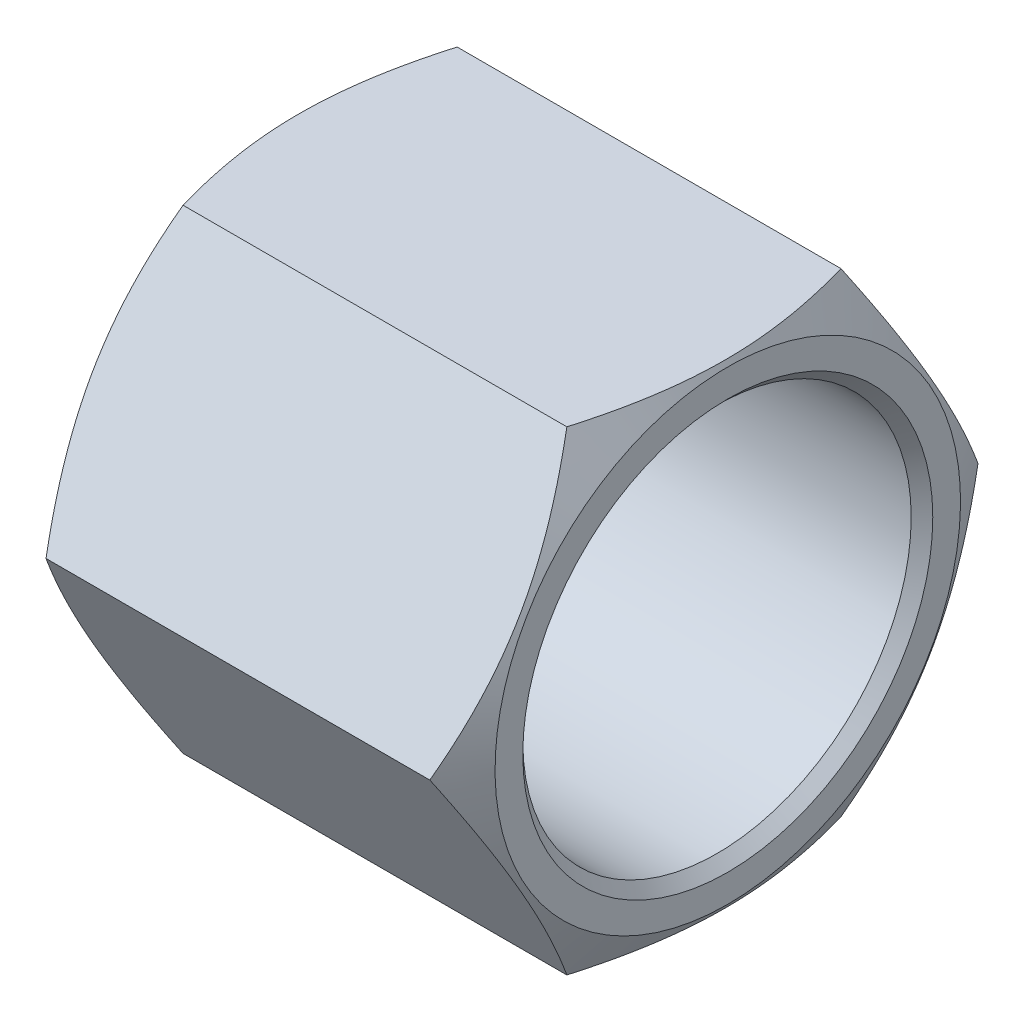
ISO-10303-21;
HEADER;
FILE_DESCRIPTION(('STEP AP214'),'2;1');
FILE_NAME('part.step','',(''),(''),'','','');
FILE_SCHEMA(('AUTOMOTIVE_DESIGN { 1 0 10303 214 1 1 1 1 }'));
ENDSEC;
DATA;
#1=APPLICATION_CONTEXT('core data for automotive mechanical design processes');
#2=APPLICATION_PROTOCOL_DEFINITION('international standard','automotive_design',2000,#1);
#3=PRODUCT_CONTEXT('',#1,'mechanical');
#4=PRODUCT('Part','Part','',(#3));
#5=PRODUCT_RELATED_PRODUCT_CATEGORY('part','',(#4));
#6=PRODUCT_DEFINITION_FORMATION('','',#4);
#7=PRODUCT_DEFINITION_CONTEXT('part definition',#1,'design');
#8=PRODUCT_DEFINITION('design','',#6,#7);
#9=PRODUCT_DEFINITION_SHAPE('','',#8);
#10=(LENGTH_UNIT() NAMED_UNIT(*) SI_UNIT(.MILLI.,.METRE.));
#11=(NAMED_UNIT(*) PLANE_ANGLE_UNIT() SI_UNIT($,.RADIAN.));
#12=(NAMED_UNIT(*) SI_UNIT($,.STERADIAN.) SOLID_ANGLE_UNIT());
#13=UNCERTAINTY_MEASURE_WITH_UNIT(LENGTH_MEASURE(1.E-05),#10,'distance_accuracy_value','');
#14=(GEOMETRIC_REPRESENTATION_CONTEXT(3) GLOBAL_UNCERTAINTY_ASSIGNED_CONTEXT((#13)) GLOBAL_UNIT_ASSIGNED_CONTEXT((#10,
#11,#12)) REPRESENTATION_CONTEXT('',''));
#15=CARTESIAN_POINT('',(0.,0.,0.));
#16=DIRECTION('',(0.,0.,1.));
#17=DIRECTION('',(1.,0.,0.));
#18=AXIS2_PLACEMENT_3D('',#15,#16,#17);
#19=CARTESIAN_POINT('',(20.,0.,0.));
#20=DIRECTION('',(1.,0.,0.));
#21=DIRECTION('',(0.,0.,-1.));
#22=AXIS2_PLACEMENT_3D('',#19,#20,#21);
#23=CYLINDRICAL_SURFACE('',#22,10.);
#24=CARTESIAN_POINT('',(5.,0.,0.));
#25=DIRECTION('',(1.,0.,0.));
#26=DIRECTION('',(0.,0.,-1.));
#27=AXIS2_PLACEMENT_3D('',#24,#25,#26);
#28=CIRCLE('',#27,10.);
#29=CARTESIAN_POINT('',(5.,0.,-10.));
#30=VERTEX_POINT('',#29);
#31=EDGE_CURVE('P0_E20',#30,#30,#28,.T.);
#32=ORIENTED_EDGE('',*,*,#31,.T.);
#33=EDGE_LOOP('',(#32));
#34=FACE_BOUND('',#33,.T.);
#35=CARTESIAN_POINT('',(20.,0.,0.));
#36=DIRECTION('',(1.,0.,0.));
#37=DIRECTION('',(0.,0.,-1.));
#38=AXIS2_PLACEMENT_3D('',#35,#36,#37);
#39=CIRCLE('',#38,10.);
#40=CARTESIAN_POINT('',(20.,0.,-10.));
#41=VERTEX_POINT('',#40);
#42=EDGE_CURVE('P0_E11',#41,#41,#39,.F.);
#43=ORIENTED_EDGE('',*,*,#42,.T.);
#44=EDGE_LOOP('',(#43));
#45=FACE_BOUND('',#44,.T.);
#46=ADVANCED_FACE('P0_F16',(#34,#45),#23,.T.);
#47=CARTESIAN_POINT('',(5.,0.,0.));
#48=DIRECTION('',(1.,0.,0.));
#49=DIRECTION('',(0.,0.,-1.));
#50=AXIS2_PLACEMENT_3D('',#47,#48,#49);
#51=PLANE('',#50);
#52=CARTESIAN_POINT('',(5.,-9.,0.));
#53=CARTESIAN_POINT('',(5.,-8.99990265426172,0.825985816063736));
#54=CARTESIAN_POINT('',(5.,-8.84974831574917,1.63766747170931));
#55=CARTESIAN_POINT('',(5.,-8.6905594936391,2.49818637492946));
#56=CARTESIAN_POINT('',(5.,-8.36809470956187,3.31285238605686));
#57=CARTESIAN_POINT('',(5.,-8.03248230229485,4.1607341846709));
#58=CARTESIAN_POINT('',(5.,-7.53295960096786,4.92488778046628));
#59=CARTESIAN_POINT('',(5.,-7.02331003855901,5.70453311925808));
#60=CARTESIAN_POINT('',(5.,-6.36396103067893,6.36396103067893));
#61=CARTESIAN_POINT('',(5.,-5.70536941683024,7.02263145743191));
#62=CARTESIAN_POINT('',(5.,-4.92488778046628,7.53295960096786));
#63=CARTESIAN_POINT('',(5.,-4.16167124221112,8.03199873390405));
#64=CARTESIAN_POINT('',(5.,-3.31285238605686,8.36809470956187));
#65=CARTESIAN_POINT('',(5.,-2.4991952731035,8.69026813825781));
#66=CARTESIAN_POINT('',(5.,-1.63766747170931,8.84974831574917));
#67=CARTESIAN_POINT('',(5.,-0.826255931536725,8.99995131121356));
#68=CARTESIAN_POINT('',(5.,0.,9.));
#69=CARTESIAN_POINT('',(5.,0.825196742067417,9.00004862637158));
#70=CARTESIAN_POINT('',(5.,1.6376674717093,8.84974831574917));
#71=CARTESIAN_POINT('',(5.,2.49818637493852,8.69055949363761));
#72=CARTESIAN_POINT('',(5.,3.31285238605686,8.36809470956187));
#73=CARTESIAN_POINT('',(5.,4.16073418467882,8.03248230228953));
#74=CARTESIAN_POINT('',(5.,4.92488778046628,7.53295960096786));
#75=CARTESIAN_POINT('',(5.,5.70453311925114,7.02331003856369));
#76=CARTESIAN_POINT('',(5.,6.36396103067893,6.36396103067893));
#77=CARTESIAN_POINT('',(5.,7.02263145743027,5.70536941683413));
#78=CARTESIAN_POINT('',(5.,7.53295960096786,4.92488778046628));
#79=CARTESIAN_POINT('',(5.,8.03199873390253,4.1616712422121));
#80=CARTESIAN_POINT('',(5.,8.36809470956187,3.31285238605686));
#81=CARTESIAN_POINT('',(5.,8.69026813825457,2.49919527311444));
#82=CARTESIAN_POINT('',(5.,8.84974831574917,1.63766747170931));
#83=CARTESIAN_POINT('',(5.,8.99990259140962,0.826519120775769));
#84=CARTESIAN_POINT('',(5.,9.,0.));
#85=B_SPLINE_CURVE_WITH_KNOTS('',2,(#52,#53,#54,#55,#56,#57,#58,#59,#60,#61,#62,#63,#64,#65,#66,
#67,#68,#69,#70,#71,#72,#73,#74,#75,#76,#77,#78,#79,#80,#81,#82,#83,#84),.UNSPECIFIED.,.F.,.F.,
(3,2,2,2,2,2,2,2,2,2,2,2,2,2,2,2,3),(0.,0.0625,0.125,0.1875,0.25,0.3125,0.375,0.4375,0.5,0.5625,
0.625,0.6875,0.75,0.8125,0.875,0.9375,1.),.UNSPECIFIED.);
#86=CARTESIAN_POINT('',(5.,-9.,0.));
#87=VERTEX_POINT('',#86);
#88=CARTESIAN_POINT('',(5.,9.,0.));
#89=VERTEX_POINT('',#88);
#90=EDGE_CURVE('P0_E28',#87,#89,#85,.T.);
#91=ORIENTED_EDGE('',*,*,#90,.F.);
#92=CARTESIAN_POINT('',(5.,9.,0.));
#93=CARTESIAN_POINT('',(5.,8.99990265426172,-0.825985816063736));
#94=CARTESIAN_POINT('',(5.,8.84974831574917,-1.63766747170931));
#95=CARTESIAN_POINT('',(5.,8.6905594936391,-2.49818637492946));
#96=CARTESIAN_POINT('',(5.,8.36809470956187,-3.31285238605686));
#97=CARTESIAN_POINT('',(5.,8.03248230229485,-4.1607341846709));
#98=CARTESIAN_POINT('',(5.,7.53295960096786,-4.92488778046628));
#99=CARTESIAN_POINT('',(5.,7.02331003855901,-5.70453311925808));
#100=CARTESIAN_POINT('',(5.,6.36396103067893,-6.36396103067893));
#101=CARTESIAN_POINT('',(5.,5.70536941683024,-7.02263145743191));
#102=CARTESIAN_POINT('',(5.,4.92488778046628,-7.53295960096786));
#103=CARTESIAN_POINT('',(5.,4.16167124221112,-8.03199873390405));
#104=CARTESIAN_POINT('',(5.,3.31285238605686,-8.36809470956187));
#105=CARTESIAN_POINT('',(5.,2.4991952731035,-8.69026813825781));
#106=CARTESIAN_POINT('',(5.,1.63766747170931,-8.84974831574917));
#107=CARTESIAN_POINT('',(5.,0.826255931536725,-8.99995131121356));
#108=CARTESIAN_POINT('',(5.,0.,-9.));
#109=CARTESIAN_POINT('',(5.,-0.825196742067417,-9.00004862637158));
#110=CARTESIAN_POINT('',(5.,-1.6376674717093,-8.84974831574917));
#111=CARTESIAN_POINT('',(5.,-2.49818637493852,-8.69055949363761));
#112=CARTESIAN_POINT('',(5.,-3.31285238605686,-8.36809470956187));
#113=CARTESIAN_POINT('',(5.,-4.16073418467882,-8.03248230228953));
#114=CARTESIAN_POINT('',(5.,-4.92488778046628,-7.53295960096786));
#115=CARTESIAN_POINT('',(5.,-5.70453311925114,-7.02331003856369));
#116=CARTESIAN_POINT('',(5.,-6.36396103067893,-6.36396103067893));
#117=CARTESIAN_POINT('',(5.,-7.02263145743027,-5.70536941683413));
#118=CARTESIAN_POINT('',(5.,-7.53295960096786,-4.92488778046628));
#119=CARTESIAN_POINT('',(5.,-8.03199873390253,-4.1616712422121));
#120=CARTESIAN_POINT('',(5.,-8.36809470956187,-3.31285238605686));
#121=CARTESIAN_POINT('',(5.,-8.69026813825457,-2.49919527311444));
#122=CARTESIAN_POINT('',(5.,-8.84974831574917,-1.63766747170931));
#123=CARTESIAN_POINT('',(5.,-8.99990259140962,-0.826519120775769));
#124=CARTESIAN_POINT('',(5.,-9.,0.));
#125=B_SPLINE_CURVE_WITH_KNOTS('',2,(#92,#93,#94,#95,#96,#97,#98,#99,#100,#101,#102,#103,#104,
#105,#106,#107,#108,#109,#110,#111,#112,#113,#114,#115,#116,#117,#118,#119,#120,#121,#122,#123,
#124),.UNSPECIFIED.,.F.,.F.,(3,2,2,2,2,2,2,2,2,2,2,2,2,2,2,2,3),(0.,0.0625,0.125,0.1875,0.25,
0.3125,0.375,0.4375,0.5,0.5625,0.625,0.6875,0.75,0.8125,0.875,0.9375,1.),.UNSPECIFIED.);
#126=EDGE_CURVE('P0_E33',#89,#87,#125,.T.);
#127=ORIENTED_EDGE('',*,*,#126,.F.);
#128=EDGE_LOOP('',(#91,#127));
#129=FACE_BOUND('',#128,.T.);
#130=ORIENTED_EDGE('',*,*,#31,.F.);
#131=EDGE_LOOP('',(#130));
#132=FACE_BOUND('',#131,.T.);
#133=ADVANCED_FACE('P0_F17',(#129,#132),#51,.F.);
#134=OPEN_SHELL('',(#46,#133));
#135=SHELL_BASED_SURFACE_MODEL('P0_B1',(#134));
#136=CARTESIAN_POINT('',(0.,-11.,6.350852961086));
#137=DIRECTION('',(0.,-1.,0.));
#138=DIRECTION('',(0.,0.,-1.));
#139=AXIS2_PLACEMENT_3D('',#136,#137,#138);
#140=PLANE('',#139);
#141=DIRECTION('',(1.,0.,0.));
#142=VECTOR('',#141,1.);
#143=CARTESIAN_POINT('',(0.,-11.,-6.350852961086));
#144=LINE('',#143,#142);
#145=CARTESIAN_POINT('',(18.8939080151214,-11.,-6.35085291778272));
#146=VERTEX_POINT('',#145);
#147=CARTESIAN_POINT('',(1.10609198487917,-10.9999999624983,-6.35085298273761));
#148=VERTEX_POINT('',#147);
#149=EDGE_CURVE('P1_E206',#146,#148,#144,.F.);
#150=ORIENTED_EDGE('',*,*,#149,.F.);
#151=CARTESIAN_POINT('',(18.8939080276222,-11.,6.35085287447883));
#152=CARTESIAN_POINT('',(18.9744931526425,-11.,6.07164385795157));
#153=CARTESIAN_POINT('',(19.0514205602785,-11.,5.79139380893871));
#154=CARTESIAN_POINT('',(19.1969450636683,-11.,5.22864634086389));
#155=CARTESIAN_POINT('',(19.2655394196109,-11.,4.94614821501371));
#156=CARTESIAN_POINT('',(19.4574953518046,-11.,4.09410215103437));
#157=CARTESIAN_POINT('',(19.5666777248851,-11.,3.52119071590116));
#158=CARTESIAN_POINT('',(19.6947020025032,-11.,2.66385506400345));
#159=CARTESIAN_POINT('',(19.7311708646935,-11.,2.38199200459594));
#160=CARTESIAN_POINT('',(19.7923256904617,-11.,1.81696094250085));
#161=CARTESIAN_POINT('',(19.8170114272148,-11.,1.53379291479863));
#162=CARTESIAN_POINT('',(19.8539676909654,-11.,0.966984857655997));
#163=CARTESIAN_POINT('',(19.8662529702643,-11.,0.683345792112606));
#164=CARTESIAN_POINT('',(19.878146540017,-11.,0.1158049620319));
#165=CARTESIAN_POINT('',(19.8777552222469,-11.,-0.168096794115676));
#166=CARTESIAN_POINT('',(19.8651810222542,-11.,-0.698837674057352));
#167=CARTESIAN_POINT('',(19.8545319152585,-11.,-0.945714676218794));
#168=CARTESIAN_POINT('',(19.8238481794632,-11.,-1.43890084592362));
#169=CARTESIAN_POINT('',(19.803812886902,-11.,-1.68520997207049));
#170=CARTESIAN_POINT('',(19.7547060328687,-11.,-2.17712654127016));
#171=CARTESIAN_POINT('',(19.7256270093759,-11.,-2.42273323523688));
#172=CARTESIAN_POINT('',(19.6589428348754,-11.,-2.91279522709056));
#173=CARTESIAN_POINT('',(19.6213371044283,-11.,-3.15725044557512));
#174=CARTESIAN_POINT('',(19.4947792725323,-11.,-3.89930718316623));
#175=CARTESIAN_POINT('',(19.3932086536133,-11.,-4.39475995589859));
#176=CARTESIAN_POINT('',(19.162685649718,-11.,-5.37827820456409));
#177=CARTESIAN_POINT('',(19.0337873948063,-11.,-5.86635627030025));
#178=CARTESIAN_POINT('',(18.893908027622,-11.,-6.35085287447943));
#179=B_SPLINE_CURVE_WITH_KNOTS('',3,(#151,#152,#153,#154,#155,#156,#157,#158,#159,#160,#161,
#162,#163,#164,#165,#166,#167,#168,#169,#170,#171,#172,#173,#174,#175,#176,#177,#178),
.UNSPECIFIED.,.F.,.F.,(4,2,2,2,2,2,2,2,2,2,2,2,2,4),(0.,0.871747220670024,1.74378029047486,
3.4915582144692,4.34399743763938,5.19645306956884,6.04789337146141,6.89930735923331,
7.64044855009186,8.38164216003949,9.12344896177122,9.86530618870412,11.3816420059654,
12.8950018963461),.UNSPECIFIED.);
#180=CARTESIAN_POINT('',(18.8939079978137,-11.0000000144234,6.3508529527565));
#181=VERTEX_POINT('',#180);
#182=EDGE_CURVE('P1_E96',#181,#146,#179,.T.);
#183=ORIENTED_EDGE('',*,*,#182,.F.);
#184=DIRECTION('',(1.,0.,0.));
#185=VECTOR('',#184,1.);
#186=CARTESIAN_POINT('',(0.,-10.9999999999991,6.35085296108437));
#187=LINE('',#186,#185);
#188=CARTESIAN_POINT('',(1.10609198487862,-10.9999999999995,6.35085291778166));
#189=VERTEX_POINT('',#188);
#190=EDGE_CURVE('P1_E204',#189,#181,#187,.T.);
#191=ORIENTED_EDGE('',*,*,#190,.F.);
#192=CARTESIAN_POINT('',(1.10609200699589,-11.,-6.35085299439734));
#193=CARTESIAN_POINT('',(1.02550688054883,-11.,-6.0716439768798));
#194=CARTESIAN_POINT('',(0.948579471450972,-11.,-5.79139392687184));
#195=CARTESIAN_POINT('',(0.803054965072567,-11.,-5.22864645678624));
#196=CARTESIAN_POINT('',(0.734460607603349,-11.,-4.94614832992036));
#197=CARTESIAN_POINT('',(0.542504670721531,-11.,-4.09410226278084));
#198=CARTESIAN_POINT('',(0.433322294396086,-11.,-3.52119082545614));
#199=CARTESIAN_POINT('',(0.30529801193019,-11.,-2.66385517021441));
#200=CARTESIAN_POINT('',(0.268829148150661,-11.,-2.38199210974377));
#201=CARTESIAN_POINT('',(0.207674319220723,-11.,-1.81696104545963));
#202=CARTESIAN_POINT('',(0.182988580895,-11.,-1.53379301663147));
#203=CARTESIAN_POINT('',(0.146032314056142,-11.,-0.966984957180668));
#204=CARTESIAN_POINT('',(0.133747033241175,-11.,-0.683345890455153));
#205=CARTESIAN_POINT('',(0.121853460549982,-11.,-0.115805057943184));
#206=CARTESIAN_POINT('',(0.122244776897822,-11.,0.168096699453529));
#207=CARTESIAN_POINT('',(0.134818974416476,-11.,0.698837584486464));
#208=CARTESIAN_POINT('',(0.145468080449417,-11.,0.945714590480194));
#209=CARTESIAN_POINT('',(0.176151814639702,-11.,1.43890076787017));
#210=CARTESIAN_POINT('',(0.196187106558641,-11.,1.68520989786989));
#211=CARTESIAN_POINT('',(0.245293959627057,-11.,2.17712647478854));
#212=CARTESIAN_POINT('',(0.27437298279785,-11.,2.42273317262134));
#213=CARTESIAN_POINT('',(0.341057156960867,-11.,2.91279517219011));
#214=CARTESIAN_POINT('',(0.378662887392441,-11.,3.15725039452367));
#215=CARTESIAN_POINT('',(0.505220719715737,-11.,3.89930714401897));
#216=CARTESIAN_POINT('',(0.606791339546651,-11.,4.39475992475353));
#217=CARTESIAN_POINT('',(0.837314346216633,-11.,5.37827818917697));
#218=CARTESIAN_POINT('',(0.966212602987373,-11.,5.86635626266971));
#219=CARTESIAN_POINT('',(1.10609197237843,-11.,6.35085287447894));
#220=B_SPLINE_CURVE_WITH_KNOTS('',3,(#192,#193,#194,#195,#196,#197,#198,#199,#200,#201,#202,
#203,#204,#205,#206,#207,#208,#209,#210,#211,#212,#213,#214,#215,#216,#217,#218,#219),
.UNSPECIFIED.,.F.,.F.,(4,2,2,2,2,2,2,2,2,2,2,2,2,4),(0.,0.871747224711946,1.74378029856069,
3.49155823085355,4.34399745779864,5.19645309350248,6.04789339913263,6.89930739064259,
7.64044859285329,8.38164221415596,9.12344902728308,9.86530626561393,11.381642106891,
12.895002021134),.UNSPECIFIED.);
#221=EDGE_CURVE('P1_E94',#148,#189,#220,.T.);
#222=ORIENTED_EDGE('',*,*,#221,.F.);
#223=EDGE_LOOP('',(#150,#183,#191,#222));
#224=FACE_BOUND('',#223,.T.);
#225=ADVANCED_FACE('P1_F16',(#224),#140,.T.);
#226=CARTESIAN_POINT('',(0.,-11.,-6.350852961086));
#227=DIRECTION('',(0.,-0.500000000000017,-0.866025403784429));
#228=DIRECTION('',(0.,0.866025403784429,-0.500000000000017));
#229=AXIS2_PLACEMENT_3D('',#226,#227,#228);
#230=PLANE('',#229);
#231=DIRECTION('',(1.,0.,0.));
#232=VECTOR('',#231,1.);
#233=CARTESIAN_POINT('',(0.,0.,-12.70170592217));
#234=LINE('',#233,#232);
#235=CARTESIAN_POINT('',(18.8939080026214,-3.56465793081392E-13,-12.7017059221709));
#236=VERTEX_POINT('',#235);
#237=CARTESIAN_POINT('',(1.10609199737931,0.,-12.7017059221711));
#238=VERTEX_POINT('',#237);
#239=EDGE_CURVE('P1_E80',#236,#238,#234,.F.);
#240=ORIENTED_EDGE('',*,*,#239,.F.);
#241=CARTESIAN_POINT('',(18.8939079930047,-11.0000000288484,-6.35085294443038));
#242=CARTESIAN_POINT('',(18.9744931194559,-10.7581979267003,-6.49045745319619));
#243=CARTESIAN_POINT('',(19.0514205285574,-10.5154942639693,-6.63058247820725));
#244=CARTESIAN_POINT('',(19.1969450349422,-10.0281406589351,-6.91195621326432));
#245=CARTESIAN_POINT('',(19.2655393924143,-9.78349010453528,-7.05320527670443));
#246=CARTESIAN_POINT('',(19.4574953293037,-9.04559656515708,-7.47922831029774));
#247=CARTESIAN_POINT('',(19.5666777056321,-8.54944070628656,-7.76568402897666));
#248=CARTESIAN_POINT('',(19.6947019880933,-7.80696624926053,-8.19435185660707));
#249=CARTESIAN_POINT('',(19.7311708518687,-7.56286567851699,-8.33528338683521));
#250=CARTESIAN_POINT('',(19.7923256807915,-7.07353442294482,-8.61779891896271));
#251=CARTESIAN_POINT('',(19.8170114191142,-6.82830371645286,-8.75938293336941));
#252=CARTESIAN_POINT('',(19.8539676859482,-6.33743353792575,-9.04278696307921));
#253=CARTESIAN_POINT('',(19.8662529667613,-6.09179490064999,-9.18460649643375));
#254=CARTESIAN_POINT('',(19.8781465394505,-5.60029012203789,-9.46837691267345));
#255=CARTESIAN_POINT('',(19.8777552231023,-5.35442398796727,-9.61032779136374));
#256=CARTESIAN_POINT('',(19.8651810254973,-4.89478889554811,-9.87569823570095));
#257=CARTESIAN_POINT('',(19.8545319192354,-4.68098713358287,-9.9991367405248));
#258=CARTESIAN_POINT('',(19.8238481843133,-4.2538753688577,-10.2457298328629));
#259=CARTESIAN_POINT('',(19.8038128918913,-4.04056540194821,-10.368884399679));
#260=CARTESIAN_POINT('',(19.7547060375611,-3.61455314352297,-10.6148426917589));
#261=CARTESIAN_POINT('',(19.7256270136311,-3.4018515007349,-10.7376460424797));
#262=CARTESIAN_POINT('',(19.6589428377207,-2.97744535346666,-10.9826770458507));
#263=CARTESIAN_POINT('',(19.621337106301,-2.76574091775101,-11.1049046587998));
#264=CARTESIAN_POINT('',(19.4947792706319,-2.1231009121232,-11.475933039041));
#265=CARTESIAN_POINT('',(19.3932086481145,-1.69402621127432,-11.7236594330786));
#266=CARTESIAN_POINT('',(19.1626856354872,-0.84227439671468,-12.2154185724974));
#267=CARTESIAN_POINT('',(19.0337873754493,-0.419586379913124,-12.459457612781));
#268=CARTESIAN_POINT('',(18.8939080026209,-7.12760304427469E-13,-12.7017059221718));
#269=B_SPLINE_CURVE_WITH_KNOTS('',3,(#241,#242,#243,#244,#245,#246,#247,#248,#249,#250,#251,
#252,#253,#254,#255,#256,#257,#258,#259,#260,#261,#262,#263,#264,#265,#266,#267,#268),
.UNSPECIFIED.,.F.,.F.,(4,2,2,2,2,2,2,2,2,2,2,2,2,4),(0.,0.871747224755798,1.74378029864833,
3.49155823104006,4.3439974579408,5.19645309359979,6.04789339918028,6.8993073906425,
7.64044860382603,8.38164223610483,9.12344906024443,9.86530630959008,11.381642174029,
12.8950021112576),.UNSPECIFIED.);
#270=EDGE_CURVE('P1_E41',#146,#236,#269,.T.);
#271=ORIENTED_EDGE('',*,*,#270,.F.);
#272=ORIENTED_EDGE('',*,*,#149,.T.);
#273=CARTESIAN_POINT('',(1.10609199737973,-6.21386941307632E-13,-12.7017059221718));
#274=CARTESIAN_POINT('',(1.02550687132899,-0.241802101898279,-12.5621014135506));
#275=CARTESIAN_POINT('',(0.948579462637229,-0.484505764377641,-12.4219763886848));
#276=CARTESIAN_POINT('',(0.803054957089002,-0.971859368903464,-12.1406026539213));
#277=CARTESIAN_POINT('',(0.734460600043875,-1.21650992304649,-11.9993535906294));
#278=CARTESIAN_POINT('',(0.542504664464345,-1.95440346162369,-11.5733305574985));
#279=CARTESIAN_POINT('',(0.433322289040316,-2.45055931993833,-11.2868748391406));
#280=CARTESIAN_POINT('',(0.305298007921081,-3.19303377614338,-10.8582070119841));
#281=CARTESIAN_POINT('',(0.268829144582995,-3.43713434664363,-10.7172754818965));
#282=CARTESIAN_POINT('',(0.207674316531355,-3.92646560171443,-10.4347599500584));
#283=CARTESIAN_POINT('',(0.182988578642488,-4.17169630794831,-10.2931759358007));
#284=CARTESIAN_POINT('',(0.146032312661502,-4.66256648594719,-10.0097719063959));
#285=CARTESIAN_POINT('',(0.133747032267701,-4.90820512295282,-9.86795237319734));
#286=CARTESIAN_POINT('',(0.121853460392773,-5.39970990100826,-9.58418195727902));
#287=CARTESIAN_POINT('',(0.122244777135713,-5.64557603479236,-9.44223107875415));
#288=CARTESIAN_POINT('',(0.134818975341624,-6.10521112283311,-9.17686063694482));
#289=CARTESIAN_POINT('',(0.145468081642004,-6.31901288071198,-9.05342213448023));
#290=CARTESIAN_POINT('',(0.176151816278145,-6.74612463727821,-8.80682904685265));
#291=CARTESIAN_POINT('',(0.196187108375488,-6.95943460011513,-8.68367448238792));
#292=CARTESIAN_POINT('',(0.245293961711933,-7.3854468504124,-8.43771619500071));
#293=CARTESIAN_POINT('',(0.274372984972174,-7.59814848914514,-8.31491284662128));
#294=CARTESIAN_POINT('',(0.341057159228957,-8.02255462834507,-8.06988184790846));
#295=CARTESIAN_POINT('',(0.378662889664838,-8.23425906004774,-7.94765423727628));
#296=CARTESIAN_POINT('',(0.505220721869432,-8.87689905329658,-7.57662586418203));
#297=CARTESIAN_POINT('',(0.606791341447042,-9.30597374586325,-7.32889947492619));
#298=CARTESIAN_POINT('',(0.837314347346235,-10.157725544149,-6.83714034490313));
#299=CARTESIAN_POINT('',(0.966212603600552,-10.5804135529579,-6.59310130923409));
#300=CARTESIAN_POINT('',(1.10609197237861,-10.9999999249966,-6.35085300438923));
#301=B_SPLINE_CURVE_WITH_KNOTS('',3,(#273,#274,#275,#276,#277,#278,#279,#280,#281,#282,#283,
#284,#285,#286,#287,#288,#289,#290,#291,#292,#293,#294,#295,#296,#297,#298,#299,#300),
.UNSPECIFIED.,.F.,.F.,(4,2,2,2,2,2,2,2,2,2,2,2,2,4),(0.,0.871747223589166,1.74378029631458,
3.49155822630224,4.34399745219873,5.19645308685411,6.04789339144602,6.89930738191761,
7.64044858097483,8.38164219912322,9.12344900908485,9.86530624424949,11.3816420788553,
12.8950019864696),.UNSPECIFIED.);
#302=EDGE_CURVE('P1_E99',#238,#148,#301,.T.);
#303=ORIENTED_EDGE('',*,*,#302,.F.);
#304=EDGE_LOOP('',(#240,#271,#272,#303));
#305=FACE_BOUND('',#304,.T.);
#306=ADVANCED_FACE('P1_F123',(#305),#230,.T.);
#307=CARTESIAN_POINT('',(0.,0.,12.70170592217));
#308=DIRECTION('',(0.,-0.500000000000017,0.866025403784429));
#309=DIRECTION('',(0.,-0.866025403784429,-0.500000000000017));
#310=AXIS2_PLACEMENT_3D('',#307,#308,#309);
#311=PLANE('',#310);
#312=ORIENTED_EDGE('',*,*,#190,.T.);
#313=CARTESIAN_POINT('',(18.8939080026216,8.73644127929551E-13,12.7017059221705));
#314=CARTESIAN_POINT('',(18.974493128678,-0.241802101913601,12.5621014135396));
#315=CARTESIAN_POINT('',(19.0514205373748,-0.484505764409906,12.421976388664));
#316=CARTESIAN_POINT('',(19.1969450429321,-0.97185936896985,12.1406026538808));
#317=CARTESIAN_POINT('',(19.2655393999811,-1.21650992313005,11.999353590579));
#318=CARTESIAN_POINT('',(19.4574953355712,-1.95440346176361,11.5733305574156));
#319=CARTESIAN_POINT('',(19.5666777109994,-2.4505593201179,11.2868748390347));
#320=CARTESIAN_POINT('',(19.6947019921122,-3.19303377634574,10.8582070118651));
#321=CARTESIAN_POINT('',(19.7311708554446,-3.43713434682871,10.7172754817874));
#322=CARTESIAN_POINT('',(19.7923256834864,-3.92646560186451,10.4347599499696));
#323=CARTESIAN_POINT('',(19.8170114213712,-4.17169630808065,10.2931759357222));
#324=CARTESIAN_POINT('',(19.8539676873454,-4.66256648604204,10.009771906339));
#325=CARTESIAN_POINT('',(19.8662529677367,-4.90820512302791,9.86795237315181));
#326=CARTESIAN_POINT('',(19.8781465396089,-5.39970990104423,9.58418195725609));
#327=CARTESIAN_POINT('',(19.8777552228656,-5.64557603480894,9.4422310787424));
#328=CARTESIAN_POINT('',(19.86518102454,-6.10521112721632,9.17686063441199));
#329=CARTESIAN_POINT('',(19.8545319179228,-6.31901288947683,9.05342212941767));
#330=CARTESIAN_POINT('',(19.8238481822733,-6.74612465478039,8.8068290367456));
#331=CARTESIAN_POINT('',(19.8038128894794,-6.959434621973,8.68367446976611));
#332=CARTESIAN_POINT('',(19.7547060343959,-7.38544688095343,8.43771617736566));
#333=CARTESIAN_POINT('',(19.7256270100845,-7.59814852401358,8.3149128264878));
#334=CARTESIAN_POINT('',(19.6589428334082,-8.02255467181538,8.06988182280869));
#335=CARTESIAN_POINT('',(19.621337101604,-8.2342591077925,7.94765420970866));
#336=CARTESIAN_POINT('',(19.4947792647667,-8.87689911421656,7.57662582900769));
#337=CARTESIAN_POINT('',(19.3932086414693,-9.30597381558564,7.32889943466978));
#338=CARTESIAN_POINT('',(19.1626856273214,-10.157725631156,6.83714029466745));
#339=CARTESIAN_POINT('',(19.0337873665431,-10.5804136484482,6.59310125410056));
#340=CARTESIAN_POINT('',(18.8939079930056,-11.0000000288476,6.35085294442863));
#341=B_SPLINE_CURVE_WITH_KNOTS('',3,(#313,#314,#315,#316,#317,#318,#319,#320,#321,#322,#323,
#324,#325,#326,#327,#328,#329,#330,#331,#332,#333,#334,#335,#336,#337,#338,#339,#340),
.UNSPECIFIED.,.F.,.F.,(4,2,2,2,2,2,2,2,2,2,2,2,2,4),(0.,0.871747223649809,1.74378029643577,
3.49155822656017,4.34399745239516,5.19645308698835,6.04789339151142,6.89930738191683,
7.64044859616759,8.38164222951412,9.1234490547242,9.86530630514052,11.3816421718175,
12.8950021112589),.UNSPECIFIED.);
#342=CARTESIAN_POINT('',(18.8939080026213,7.93014808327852E-13,12.7017059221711));
#343=VERTEX_POINT('',#342);
#344=EDGE_CURVE('P1_E76',#343,#181,#341,.T.);
#345=ORIENTED_EDGE('',*,*,#344,.F.);
#346=DIRECTION('',(1.,0.,0.));
#347=VECTOR('',#346,1.);
#348=CARTESIAN_POINT('',(0.,9.36750677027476E-13,12.7017059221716));
#349=LINE('',#348,#347);
#350=CARTESIAN_POINT('',(1.10609199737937,7.94206407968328E-13,12.7017059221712));
#351=VERTEX_POINT('',#350);
#352=EDGE_CURVE('P1_E70',#351,#343,#349,.T.);
#353=ORIENTED_EDGE('',*,*,#352,.F.);
#354=CARTESIAN_POINT('',(1.10609200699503,-11.0000000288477,6.35085294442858));
#355=CARTESIAN_POINT('',(1.02550688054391,-10.7581979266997,6.49045745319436));
#356=CARTESIAN_POINT('',(0.948579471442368,-10.5154942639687,6.63058247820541));
#357=CARTESIAN_POINT('',(0.803054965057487,-10.0281406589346,6.91195621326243));
#358=CARTESIAN_POINT('',(0.73446060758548,-9.78349010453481,7.05320527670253));
#359=CARTESIAN_POINT('',(0.542504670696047,-9.0455965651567,7.47922831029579));
#360=CARTESIAN_POINT('',(0.433322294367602,-8.54944070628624,7.76568402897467));
#361=CARTESIAN_POINT('',(0.305298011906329,-7.80696624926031,8.19435185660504));
#362=CARTESIAN_POINT('',(0.268829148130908,-7.56286567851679,8.33528338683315));
#363=CARTESIAN_POINT('',(0.207674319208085,-7.07353442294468,8.61779891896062));
#364=CARTESIAN_POINT('',(0.182988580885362,-6.82830371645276,8.7593829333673));
#365=CARTESIAN_POINT('',(0.146032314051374,-6.3374335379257,9.04278696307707));
#366=CARTESIAN_POINT('',(0.133747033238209,-6.09179490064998,9.18460649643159));
#367=CARTESIAN_POINT('',(0.121853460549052,-5.60029012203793,9.46837691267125));
#368=CARTESIAN_POINT('',(0.122244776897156,-5.35442398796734,9.61032779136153));
#369=CARTESIAN_POINT('',(0.13481897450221,-4.89478889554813,9.87569823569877));
#370=CARTESIAN_POINT('',(0.145468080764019,-4.68098713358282,9.99913674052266));
#371=CARTESIAN_POINT('',(0.176151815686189,-4.25387536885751,10.2457298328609));
#372=CARTESIAN_POINT('',(0.196187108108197,-4.04056540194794,10.368884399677));
#373=CARTESIAN_POINT('',(0.245293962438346,-3.61455314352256,10.6148426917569));
#374=CARTESIAN_POINT('',(0.274372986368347,-3.40185150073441,10.7376460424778));
#375=CARTESIAN_POINT('',(0.341057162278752,-2.97744535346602,10.9826770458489));
#376=CARTESIAN_POINT('',(0.378662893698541,-2.7657409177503,11.104904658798));
#377=CARTESIAN_POINT('',(0.505220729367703,-2.12310091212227,11.4759330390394));
#378=CARTESIAN_POINT('',(0.606791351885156,-1.69402621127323,11.7236594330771));
#379=CARTESIAN_POINT('',(0.837314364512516,-0.842274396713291,12.215418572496));
#380=CARTESIAN_POINT('',(0.966212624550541,-0.41958637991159,12.4594576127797));
#381=CARTESIAN_POINT('',(1.10609199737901,9.64725929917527E-13,12.7017059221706));
#382=B_SPLINE_CURVE_WITH_KNOTS('',3,(#354,#355,#356,#357,#358,#359,#360,#361,#362,#363,#364,
#365,#366,#367,#368,#369,#370,#371,#372,#373,#374,#375,#376,#377,#378,#379,#380,#381),
.UNSPECIFIED.,.F.,.F.,(4,2,2,2,2,2,2,2,2,2,2,2,2,4),(0.,0.871747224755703,1.74378029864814,
3.49155823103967,4.34399745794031,5.1964530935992,6.04789339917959,6.89930739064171,
7.64044860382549,8.38164223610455,9.1234490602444,9.86530630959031,11.3816421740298,
12.8950021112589),.UNSPECIFIED.);
#383=EDGE_CURVE('P1_E74',#189,#351,#382,.T.);
#384=ORIENTED_EDGE('',*,*,#383,.F.);
#385=EDGE_LOOP('',(#312,#345,#353,#384));
#386=FACE_BOUND('',#385,.T.);
#387=ADVANCED_FACE('P1_F72',(#386),#311,.T.);
#388=CARTESIAN_POINT('',(0.,11.,-6.350852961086));
#389=DIRECTION('',(0.,1.,0.));
#390=DIRECTION('',(0.,0.,1.));
#391=AXIS2_PLACEMENT_3D('',#388,#389,#390);
#392=PLANE('',#391);
#393=DIRECTION('',(1.,0.,0.));
#394=VECTOR('',#393,1.);
#395=CARTESIAN_POINT('',(0.,11.,6.350852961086));
#396=LINE('',#395,#394);
#397=CARTESIAN_POINT('',(18.8939080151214,11.,6.35085291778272));
#398=VERTEX_POINT('',#397);
#399=CARTESIAN_POINT('',(1.10609198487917,10.9999999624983,6.35085298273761));
#400=VERTEX_POINT('',#399);
#401=EDGE_CURVE('P1_E81',#398,#400,#396,.F.);
#402=ORIENTED_EDGE('',*,*,#401,.F.);
#403=CARTESIAN_POINT('',(18.8939080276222,11.,-6.35085287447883));
#404=CARTESIAN_POINT('',(18.9744931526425,11.,-6.07164385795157));
#405=CARTESIAN_POINT('',(19.0514205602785,11.,-5.79139380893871));
#406=CARTESIAN_POINT('',(19.1969450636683,11.,-5.22864634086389));
#407=CARTESIAN_POINT('',(19.2655394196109,11.,-4.94614821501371));
#408=CARTESIAN_POINT('',(19.4574953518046,11.,-4.09410215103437));
#409=CARTESIAN_POINT('',(19.5666777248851,11.,-3.52119071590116));
#410=CARTESIAN_POINT('',(19.6947020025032,11.,-2.66385506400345));
#411=CARTESIAN_POINT('',(19.7311708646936,11.,-2.38199200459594));
#412=CARTESIAN_POINT('',(19.7923256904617,11.,-1.81696094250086));
#413=CARTESIAN_POINT('',(19.8170114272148,11.,-1.53379291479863));
#414=CARTESIAN_POINT('',(19.8539676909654,11.,-0.966984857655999));
#415=CARTESIAN_POINT('',(19.8662529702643,11.,-0.683345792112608));
#416=CARTESIAN_POINT('',(19.878146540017,11.,-0.115804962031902));
#417=CARTESIAN_POINT('',(19.8777552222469,11.,0.168096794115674));
#418=CARTESIAN_POINT('',(19.8651810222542,11.,0.698837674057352));
#419=CARTESIAN_POINT('',(19.8545319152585,11.,0.945714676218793));
#420=CARTESIAN_POINT('',(19.8238481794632,11.,1.43890084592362));
#421=CARTESIAN_POINT('',(19.803812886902,11.,1.68520997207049));
#422=CARTESIAN_POINT('',(19.7547060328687,11.,2.17712654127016));
#423=CARTESIAN_POINT('',(19.7256270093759,11.,2.42273323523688));
#424=CARTESIAN_POINT('',(19.6589428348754,11.,2.91279522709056));
#425=CARTESIAN_POINT('',(19.6213371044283,11.,3.15725044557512));
#426=CARTESIAN_POINT('',(19.4947792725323,11.,3.89930718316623));
#427=CARTESIAN_POINT('',(19.3932086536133,11.,4.39475995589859));
#428=CARTESIAN_POINT('',(19.162685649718,11.,5.37827820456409));
#429=CARTESIAN_POINT('',(19.0337873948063,11.,5.86635627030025));
#430=CARTESIAN_POINT('',(18.893908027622,11.,6.35085287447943));
#431=B_SPLINE_CURVE_WITH_KNOTS('',3,(#403,#404,#405,#406,#407,#408,#409,#410,#411,#412,#413,
#414,#415,#416,#417,#418,#419,#420,#421,#422,#423,#424,#425,#426,#427,#428,#429,#430),
.UNSPECIFIED.,.F.,.F.,(4,2,2,2,2,2,2,2,2,2,2,2,2,4),(0.,0.871747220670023,1.74378029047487,
3.4915582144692,4.34399743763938,5.19645306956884,6.04789337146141,6.89930735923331,
7.64044855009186,8.38164216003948,9.12344896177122,9.86530618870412,11.3816420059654,
12.8950018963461),.UNSPECIFIED.);
#432=CARTESIAN_POINT('',(18.8939079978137,11.0000000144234,-6.3508529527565));
#433=VERTEX_POINT('',#432);
#434=EDGE_CURVE('P1_E133',#433,#398,#431,.T.);
#435=ORIENTED_EDGE('',*,*,#434,.F.);
#436=DIRECTION('',(1.,0.,0.));
#437=VECTOR('',#436,1.);
#438=CARTESIAN_POINT('',(0.,10.9999999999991,-6.35085296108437));
#439=LINE('',#438,#437);
#440=CARTESIAN_POINT('',(1.10609198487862,10.9999999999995,-6.35085291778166));
#441=VERTEX_POINT('',#440);
#442=EDGE_CURVE('P1_E90',#441,#433,#439,.T.);
#443=ORIENTED_EDGE('',*,*,#442,.F.);
#444=CARTESIAN_POINT('',(1.10609200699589,11.,6.35085299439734));
#445=CARTESIAN_POINT('',(1.02550688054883,11.,6.0716439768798));
#446=CARTESIAN_POINT('',(0.948579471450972,11.,5.79139392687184));
#447=CARTESIAN_POINT('',(0.803054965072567,11.,5.22864645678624));
#448=CARTESIAN_POINT('',(0.734460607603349,11.,4.94614832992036));
#449=CARTESIAN_POINT('',(0.542504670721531,11.,4.09410226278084));
#450=CARTESIAN_POINT('',(0.433322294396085,11.,3.52119082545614));
#451=CARTESIAN_POINT('',(0.30529801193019,11.,2.66385517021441));
#452=CARTESIAN_POINT('',(0.268829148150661,11.,2.38199210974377));
#453=CARTESIAN_POINT('',(0.207674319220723,11.,1.81696104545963));
#454=CARTESIAN_POINT('',(0.182988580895,11.,1.53379301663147));
#455=CARTESIAN_POINT('',(0.146032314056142,11.,0.96698495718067));
#456=CARTESIAN_POINT('',(0.133747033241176,11.,0.683345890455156));
#457=CARTESIAN_POINT('',(0.121853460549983,11.,0.115805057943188));
#458=CARTESIAN_POINT('',(0.122244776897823,11.,-0.168096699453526));
#459=CARTESIAN_POINT('',(0.134818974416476,11.,-0.69883758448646));
#460=CARTESIAN_POINT('',(0.145468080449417,11.,-0.945714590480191));
#461=CARTESIAN_POINT('',(0.176151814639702,11.,-1.43890076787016));
#462=CARTESIAN_POINT('',(0.196187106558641,11.,-1.68520989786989));
#463=CARTESIAN_POINT('',(0.245293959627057,11.,-2.17712647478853));
#464=CARTESIAN_POINT('',(0.27437298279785,11.,-2.42273317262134));
#465=CARTESIAN_POINT('',(0.341057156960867,11.,-2.91279517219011));
#466=CARTESIAN_POINT('',(0.378662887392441,11.,-3.15725039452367));
#467=CARTESIAN_POINT('',(0.505220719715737,11.,-3.89930714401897));
#468=CARTESIAN_POINT('',(0.60679133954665,11.,-4.39475992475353));
#469=CARTESIAN_POINT('',(0.837314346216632,11.,-5.37827818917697));
#470=CARTESIAN_POINT('',(0.966212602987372,11.,-5.86635626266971));
#471=CARTESIAN_POINT('',(1.10609197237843,11.,-6.35085287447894));
#472=B_SPLINE_CURVE_WITH_KNOTS('',3,(#444,#445,#446,#447,#448,#449,#450,#451,#452,#453,#454,
#455,#456,#457,#458,#459,#460,#461,#462,#463,#464,#465,#466,#467,#468,#469,#470,#471),
.UNSPECIFIED.,.F.,.F.,(4,2,2,2,2,2,2,2,2,2,2,2,2,4),(0.,0.871747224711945,1.74378029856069,
3.49155823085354,4.34399745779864,5.19645309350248,6.04789339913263,6.89930739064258,
7.64044859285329,8.38164221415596,9.12344902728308,9.86530626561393,11.381642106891,
12.895002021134),.UNSPECIFIED.);
#473=EDGE_CURVE('P1_E89',#400,#441,#472,.T.);
#474=ORIENTED_EDGE('',*,*,#473,.F.);
#475=EDGE_LOOP('',(#402,#435,#443,#474));
#476=FACE_BOUND('',#475,.T.);
#477=ADVANCED_FACE('P1_F122',(#476),#392,.T.);
#478=CARTESIAN_POINT('',(0.,11.,6.350852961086));
#479=DIRECTION('',(0.,0.500000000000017,0.866025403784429));
#480=DIRECTION('',(0.,-0.866025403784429,0.500000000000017));
#481=AXIS2_PLACEMENT_3D('',#478,#479,#480);
#482=PLANE('',#481);
#483=ORIENTED_EDGE('',*,*,#352,.T.);
#484=CARTESIAN_POINT('',(18.8939079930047,11.0000000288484,6.35085294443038));
#485=CARTESIAN_POINT('',(18.9744931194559,10.7581979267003,6.49045745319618));
#486=CARTESIAN_POINT('',(19.0514205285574,10.5154942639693,6.63058247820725));
#487=CARTESIAN_POINT('',(19.1969450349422,10.0281406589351,6.91195621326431));
#488=CARTESIAN_POINT('',(19.2655393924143,9.78349010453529,7.05320527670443));
#489=CARTESIAN_POINT('',(19.4574953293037,9.04559656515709,7.47922831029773));
#490=CARTESIAN_POINT('',(19.5666777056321,8.54944070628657,7.76568402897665));
#491=CARTESIAN_POINT('',(19.6947019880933,7.80696624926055,8.19435185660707));
#492=CARTESIAN_POINT('',(19.7311708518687,7.562865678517,8.3352833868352));
#493=CARTESIAN_POINT('',(19.7923256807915,7.07353442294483,8.61779891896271));
#494=CARTESIAN_POINT('',(19.8170114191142,6.82830371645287,8.7593829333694));
#495=CARTESIAN_POINT('',(19.8539676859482,6.33743353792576,9.04278696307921));
#496=CARTESIAN_POINT('',(19.8662529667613,6.09179490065,9.18460649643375));
#497=CARTESIAN_POINT('',(19.8781465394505,5.60029012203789,9.46837691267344));
#498=CARTESIAN_POINT('',(19.8777552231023,5.35442398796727,9.61032779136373));
#499=CARTESIAN_POINT('',(19.8651810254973,4.89478889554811,9.87569823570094));
#500=CARTESIAN_POINT('',(19.8545319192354,4.68098713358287,9.9991367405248));
#501=CARTESIAN_POINT('',(19.8238481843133,4.25387536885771,10.2457298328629));
#502=CARTESIAN_POINT('',(19.8038128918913,4.04056540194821,10.368884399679));
#503=CARTESIAN_POINT('',(19.7547060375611,3.61455314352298,10.6148426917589));
#504=CARTESIAN_POINT('',(19.7256270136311,3.4018515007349,10.7376460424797));
#505=CARTESIAN_POINT('',(19.6589428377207,2.97744535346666,10.9826770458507));
#506=CARTESIAN_POINT('',(19.621337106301,2.76574091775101,11.1049046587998));
#507=CARTESIAN_POINT('',(19.4947792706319,2.1231009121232,11.475933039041));
#508=CARTESIAN_POINT('',(19.3932086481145,1.69402621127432,11.7236594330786));
#509=CARTESIAN_POINT('',(19.1626856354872,0.842274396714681,12.2154185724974));
#510=CARTESIAN_POINT('',(19.0337873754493,0.419586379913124,12.459457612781));
#511=CARTESIAN_POINT('',(18.8939080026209,7.11458436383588E-13,12.7017059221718));
#512=B_SPLINE_CURVE_WITH_KNOTS('',3,(#484,#485,#486,#487,#488,#489,#490,#491,#492,#493,#494,
#495,#496,#497,#498,#499,#500,#501,#502,#503,#504,#505,#506,#507,#508,#509,#510,#511),
.UNSPECIFIED.,.F.,.F.,(4,2,2,2,2,2,2,2,2,2,2,2,2,4),(0.,0.871747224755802,1.74378029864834,
3.49155823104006,4.3439974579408,5.1964530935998,6.04789339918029,6.89930739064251,
7.64044860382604,8.38164223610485,9.12344906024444,9.86530630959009,11.3816421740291,
12.8950021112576),.UNSPECIFIED.);
#513=EDGE_CURVE('P1_E152',#398,#343,#512,.T.);
#514=ORIENTED_EDGE('',*,*,#513,.F.);
#515=ORIENTED_EDGE('',*,*,#401,.T.);
#516=CARTESIAN_POINT('',(1.10609199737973,6.21154367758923E-13,12.7017059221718));
#517=CARTESIAN_POINT('',(1.02550687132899,0.241802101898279,12.5621014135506));
#518=CARTESIAN_POINT('',(0.94857946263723,0.484505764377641,12.4219763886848));
#519=CARTESIAN_POINT('',(0.803054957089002,0.971859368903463,12.1406026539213));
#520=CARTESIAN_POINT('',(0.734460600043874,1.21650992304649,11.9993535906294));
#521=CARTESIAN_POINT('',(0.542504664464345,1.95440346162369,11.5733305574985));
#522=CARTESIAN_POINT('',(0.433322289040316,2.45055931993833,11.2868748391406));
#523=CARTESIAN_POINT('',(0.305298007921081,3.19303377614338,10.8582070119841));
#524=CARTESIAN_POINT('',(0.268829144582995,3.43713434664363,10.7172754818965));
#525=CARTESIAN_POINT('',(0.207674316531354,3.92646560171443,10.4347599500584));
#526=CARTESIAN_POINT('',(0.182988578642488,4.17169630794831,10.2931759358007));
#527=CARTESIAN_POINT('',(0.146032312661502,4.66256648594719,10.0097719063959));
#528=CARTESIAN_POINT('',(0.133747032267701,4.90820512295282,9.86795237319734));
#529=CARTESIAN_POINT('',(0.121853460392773,5.39970990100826,9.58418195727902));
#530=CARTESIAN_POINT('',(0.122244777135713,5.64557603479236,9.44223107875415));
#531=CARTESIAN_POINT('',(0.134818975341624,6.10521112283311,9.17686063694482));
#532=CARTESIAN_POINT('',(0.145468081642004,6.31901288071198,9.05342213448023));
#533=CARTESIAN_POINT('',(0.176151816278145,6.74612463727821,8.80682904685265));
#534=CARTESIAN_POINT('',(0.196187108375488,6.95943460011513,8.68367448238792));
#535=CARTESIAN_POINT('',(0.245293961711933,7.3854468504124,8.43771619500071));
#536=CARTESIAN_POINT('',(0.274372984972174,7.59814848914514,8.31491284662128));
#537=CARTESIAN_POINT('',(0.341057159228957,8.02255462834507,8.06988184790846));
#538=CARTESIAN_POINT('',(0.378662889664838,8.23425906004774,7.94765423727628));
#539=CARTESIAN_POINT('',(0.505220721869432,8.87689905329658,7.57662586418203));
#540=CARTESIAN_POINT('',(0.606791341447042,9.30597374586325,7.32889947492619));
#541=CARTESIAN_POINT('',(0.837314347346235,10.157725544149,6.83714034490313));
#542=CARTESIAN_POINT('',(0.966212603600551,10.5804135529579,6.59310130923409));
#543=CARTESIAN_POINT('',(1.10609197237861,10.9999999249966,6.35085300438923));
#544=B_SPLINE_CURVE_WITH_KNOTS('',3,(#516,#517,#518,#519,#520,#521,#522,#523,#524,#525,#526,
#527,#528,#529,#530,#531,#532,#533,#534,#535,#536,#537,#538,#539,#540,#541,#542,#543),
.UNSPECIFIED.,.F.,.F.,(4,2,2,2,2,2,2,2,2,2,2,2,2,4),(0.,0.871747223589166,1.74378029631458,
3.49155822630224,4.34399745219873,5.19645308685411,6.04789339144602,6.89930738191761,
7.64044858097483,8.38164219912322,9.12344900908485,9.86530624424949,11.3816420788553,
12.8950019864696),.UNSPECIFIED.);
#545=EDGE_CURVE('P1_E20',#351,#400,#544,.T.);
#546=ORIENTED_EDGE('',*,*,#545,.F.);
#547=EDGE_LOOP('',(#483,#514,#515,#546));
#548=FACE_BOUND('',#547,.T.);
#549=ADVANCED_FACE('P1_F85',(#548),#482,.T.);
#550=CARTESIAN_POINT('',(0.,0.,-12.70170592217));
#551=DIRECTION('',(0.,0.500000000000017,-0.866025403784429));
#552=DIRECTION('',(0.,0.866025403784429,0.500000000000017));
#553=AXIS2_PLACEMENT_3D('',#550,#551,#552);
#554=PLANE('',#553);
#555=ORIENTED_EDGE('',*,*,#442,.T.);
#556=CARTESIAN_POINT('',(18.8939080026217,-6.57211796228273E-13,-12.7017059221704));
#557=CARTESIAN_POINT('',(18.974493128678,0.241802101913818,-12.5621014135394));
#558=CARTESIAN_POINT('',(19.0514205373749,0.484505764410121,-12.4219763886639));
#559=CARTESIAN_POINT('',(19.1969450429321,0.971859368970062,-12.1406026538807));
#560=CARTESIAN_POINT('',(19.2655393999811,1.21650992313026,-11.9993535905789));
#561=CARTESIAN_POINT('',(19.4574953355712,1.95440346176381,-11.5733305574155));
#562=CARTESIAN_POINT('',(19.5666777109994,2.4505593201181,-11.2868748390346));
#563=CARTESIAN_POINT('',(19.6947019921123,3.19303377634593,-10.858207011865));
#564=CARTESIAN_POINT('',(19.7311708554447,3.4371343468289,-10.7172754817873));
#565=CARTESIAN_POINT('',(19.7923256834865,3.92646560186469,-10.4347599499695));
#566=CARTESIAN_POINT('',(19.8170114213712,4.17169630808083,-10.2931759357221));
#567=CARTESIAN_POINT('',(19.8539676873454,4.66256648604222,-10.0097719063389));
#568=CARTESIAN_POINT('',(19.8662529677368,4.90820512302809,-9.86795237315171));
#569=CARTESIAN_POINT('',(19.8781465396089,5.3997099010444,-9.58418195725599));
#570=CARTESIAN_POINT('',(19.8777552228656,5.64557603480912,-9.44223107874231));
#571=CARTESIAN_POINT('',(19.86518102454,6.10521112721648,-9.17686063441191));
#572=CARTESIAN_POINT('',(19.8545319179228,6.31901288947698,-9.05342212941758));
#573=CARTESIAN_POINT('',(19.8238481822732,6.74612465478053,-8.80682903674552));
#574=CARTESIAN_POINT('',(19.8038128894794,6.95943462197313,-8.68367446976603));
#575=CARTESIAN_POINT('',(19.7547060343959,7.38544688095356,-8.43771617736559));
#576=CARTESIAN_POINT('',(19.7256270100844,7.5981485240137,-8.31491282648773));
#577=CARTESIAN_POINT('',(19.6589428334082,8.02255467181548,-8.06988182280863));
#578=CARTESIAN_POINT('',(19.621337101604,8.2342591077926,-7.9476542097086));
#579=CARTESIAN_POINT('',(19.4947792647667,8.87689911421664,-7.57662582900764));
#580=CARTESIAN_POINT('',(19.3932086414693,9.30597381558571,-7.32889943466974));
#581=CARTESIAN_POINT('',(19.1626856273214,10.157725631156,-6.83714029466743));
#582=CARTESIAN_POINT('',(19.0337873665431,10.5804136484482,-6.59310125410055));
#583=CARTESIAN_POINT('',(18.8939079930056,11.0000000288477,-6.35085294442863));
#584=B_SPLINE_CURVE_WITH_KNOTS('',3,(#556,#557,#558,#559,#560,#561,#562,#563,#564,#565,#566,
#567,#568,#569,#570,#571,#572,#573,#574,#575,#576,#577,#578,#579,#580,#581,#582,#583),
.UNSPECIFIED.,.F.,.F.,(4,2,2,2,2,2,2,2,2,2,2,2,2,4),(0.,0.871747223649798,1.74378029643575,
3.49155822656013,4.34399745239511,5.1964530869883,6.04789339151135,6.89930738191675,
7.6404485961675,8.38164222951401,9.12344905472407,9.86530630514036,11.3816421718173,
12.8950021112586),.UNSPECIFIED.);
#585=EDGE_CURVE('P1_E161',#236,#433,#584,.T.);
#586=ORIENTED_EDGE('',*,*,#585,.F.);
#587=ORIENTED_EDGE('',*,*,#239,.T.);
#588=CARTESIAN_POINT('',(1.10609200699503,11.0000000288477,-6.35085294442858));
#589=CARTESIAN_POINT('',(1.02550688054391,10.7581979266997,-6.49045745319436));
#590=CARTESIAN_POINT('',(0.948579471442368,10.5154942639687,-6.63058247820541));
#591=CARTESIAN_POINT('',(0.803054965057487,10.0281406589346,-6.91195621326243));
#592=CARTESIAN_POINT('',(0.734460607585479,9.78349010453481,-7.05320527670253));
#593=CARTESIAN_POINT('',(0.542504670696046,9.0455965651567,-7.47922831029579));
#594=CARTESIAN_POINT('',(0.433322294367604,8.54944070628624,-7.76568402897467));
#595=CARTESIAN_POINT('',(0.30529801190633,7.80696624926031,-8.19435185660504));
#596=CARTESIAN_POINT('',(0.268829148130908,7.56286567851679,-8.33528338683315));
#597=CARTESIAN_POINT('',(0.207674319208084,7.07353442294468,-8.61779891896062));
#598=CARTESIAN_POINT('',(0.182988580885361,6.82830371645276,-8.7593829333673));
#599=CARTESIAN_POINT('',(0.146032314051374,6.3374335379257,-9.04278696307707));
#600=CARTESIAN_POINT('',(0.133747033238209,6.09179490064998,-9.18460649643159));
#601=CARTESIAN_POINT('',(0.121853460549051,5.60029012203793,-9.46837691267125));
#602=CARTESIAN_POINT('',(0.122244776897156,5.35442398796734,-9.61032779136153));
#603=CARTESIAN_POINT('',(0.13481897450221,4.89478889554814,-9.87569823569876));
#604=CARTESIAN_POINT('',(0.145468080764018,4.68098713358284,-9.99913674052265));
#605=CARTESIAN_POINT('',(0.176151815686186,4.25387536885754,-10.2457298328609));
#606=CARTESIAN_POINT('',(0.196187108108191,4.04056540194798,-10.3688843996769));
#607=CARTESIAN_POINT('',(0.245293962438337,3.61455314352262,-10.6148426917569));
#608=CARTESIAN_POINT('',(0.274372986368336,3.40185150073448,-10.7376460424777));
#609=CARTESIAN_POINT('',(0.341057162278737,2.97744535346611,-10.9826770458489));
#610=CARTESIAN_POINT('',(0.378662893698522,2.7657409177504,-11.104904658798));
#611=CARTESIAN_POINT('',(0.505220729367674,2.12310091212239,-11.4759330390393));
#612=CARTESIAN_POINT('',(0.606791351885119,1.69402621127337,-11.723659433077));
#613=CARTESIAN_POINT('',(0.837314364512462,0.842274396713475,-12.2154185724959));
#614=CARTESIAN_POINT('',(0.966212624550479,0.419586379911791,-12.4594576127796));
#615=CARTESIAN_POINT('',(1.10609199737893,-7.4914973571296E-13,-12.7017059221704));
#616=B_SPLINE_CURVE_WITH_KNOTS('',3,(#588,#589,#590,#591,#592,#593,#594,#595,#596,#597,#598,
#599,#600,#601,#602,#603,#604,#605,#606,#607,#608,#609,#610,#611,#612,#613,#614,#615),
.UNSPECIFIED.,.F.,.F.,(4,2,2,2,2,2,2,2,2,2,2,2,2,4),(0.,0.871747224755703,1.74378029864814,
3.49155823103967,4.34399745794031,5.1964530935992,6.04789339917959,6.89930739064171,
7.64044860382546,8.38164223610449,9.12344906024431,9.86530630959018,11.3816421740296,
12.8950021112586),.UNSPECIFIED.);
#617=EDGE_CURVE('P1_E176',#441,#238,#616,.T.);
#618=ORIENTED_EDGE('',*,*,#617,.F.);
#619=EDGE_LOOP('',(#555,#586,#587,#618));
#620=FACE_BOUND('',#619,.T.);
#621=ADVANCED_FACE('P1_F169',(#620),#554,.T.);
#622=CARTESIAN_POINT('',(1.11272854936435,0.,0.));
#623=DIRECTION('',(1.,0.,0.));
#624=DIRECTION('',(0.,0.,-1.));
#625=AXIS2_PLACEMENT_3D('',#622,#623,#624);
#626=CONICAL_SURFACE('',#625,12.7132007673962,1.0471975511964);
#627=CARTESIAN_POINT('',(-2.4461769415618E-12,0.,0.));
#628=DIRECTION('',(1.,0.,0.));
#629=DIRECTION('',(0.,0.,-1.));
#630=AXIS2_PLACEMENT_3D('',#627,#628,#629);
#631=CIRCLE('',#630,10.7858983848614);
#632=CARTESIAN_POINT('',(-2.4461769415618E-12,0.,-10.7858983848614));
#633=VERTEX_POINT('',#632);
#634=EDGE_CURVE('P1_E167',#633,#633,#631,.T.);
#635=ORIENTED_EDGE('',*,*,#634,.T.);
#636=EDGE_LOOP('',(#635));
#637=FACE_BOUND('',#636,.T.);
#638=ORIENTED_EDGE('',*,*,#221,.T.);
#639=ORIENTED_EDGE('',*,*,#383,.T.);
#640=ORIENTED_EDGE('',*,*,#545,.T.);
#641=ORIENTED_EDGE('',*,*,#473,.T.);
#642=ORIENTED_EDGE('',*,*,#617,.T.);
#643=ORIENTED_EDGE('',*,*,#302,.T.);
#644=EDGE_LOOP('',(#638,#639,#640,#641,#642,#643));
#645=FACE_BOUND('',#644,.T.);
#646=ADVANCED_FACE('P1_F91',(#637,#645),#626,.T.);
#647=CARTESIAN_POINT('',(18.8872714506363,0.,0.));
#648=DIRECTION('',(-1.,0.,0.));
#649=DIRECTION('',(0.,-1.,0.));
#650=AXIS2_PLACEMENT_3D('',#647,#648,#649);
#651=CONICAL_SURFACE('',#650,12.7132007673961,1.0471975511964);
#652=CARTESIAN_POINT('',(20.0000000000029,0.,0.));
#653=DIRECTION('',(-1.,0.,0.));
#654=DIRECTION('',(0.,-1.,0.));
#655=AXIS2_PLACEMENT_3D('',#652,#653,#654);
#656=CIRCLE('',#655,10.7858983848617);
#657=CARTESIAN_POINT('',(20.0000000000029,-10.7858983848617,0.));
#658=VERTEX_POINT('',#657);
#659=EDGE_CURVE('P1_E216',#658,#658,#656,.F.);
#660=ORIENTED_EDGE('',*,*,#659,.F.);
#661=EDGE_LOOP('',(#660));
#662=FACE_BOUND('',#661,.T.);
#663=ORIENTED_EDGE('',*,*,#513,.T.);
#664=ORIENTED_EDGE('',*,*,#344,.T.);
#665=ORIENTED_EDGE('',*,*,#182,.T.);
#666=ORIENTED_EDGE('',*,*,#270,.T.);
#667=ORIENTED_EDGE('',*,*,#585,.T.);
#668=ORIENTED_EDGE('',*,*,#434,.T.);
#669=EDGE_LOOP('',(#663,#664,#665,#666,#667,#668));
#670=FACE_BOUND('',#669,.T.);
#671=ADVANCED_FACE('P1_F143',(#662,#670),#651,.T.);
#672=CARTESIAN_POINT('',(0.,0.,0.));
#673=DIRECTION('',(1.,0.,0.));
#674=DIRECTION('',(0.,0.,-1.));
#675=AXIS2_PLACEMENT_3D('',#672,#673,#674);
#676=PLANE('',#675);
#677=CARTESIAN_POINT('',(0.,0.,0.));
#678=DIRECTION('',(1.,0.,0.));
#679=DIRECTION('',(0.,0.,-1.));
#680=AXIS2_PLACEMENT_3D('',#677,#678,#679);
#681=CIRCLE('',#680,6.);
#682=CARTESIAN_POINT('',(0.,0.,-6.));
#683=VERTEX_POINT('',#682);
#684=EDGE_CURVE('P1_E214',#683,#683,#681,.T.);
#685=ORIENTED_EDGE('',*,*,#684,.T.);
#686=EDGE_LOOP('',(#685));
#687=FACE_BOUND('',#686,.T.);
#688=ORIENTED_EDGE('',*,*,#634,.F.);
#689=EDGE_LOOP('',(#688));
#690=FACE_BOUND('',#689,.T.);
#691=ADVANCED_FACE('P1_F147',(#687,#690),#676,.F.);
#692=CARTESIAN_POINT('',(20.,0.,0.));
#693=DIRECTION('',(1.,0.,0.));
#694=DIRECTION('',(0.,0.,-1.));
#695=AXIS2_PLACEMENT_3D('',#692,#693,#694);
#696=PLANE('',#695);
#697=CARTESIAN_POINT('',(20.,0.,0.));
#698=DIRECTION('',(1.,0.,0.));
#699=DIRECTION('',(0.,0.,-1.));
#700=AXIS2_PLACEMENT_3D('',#697,#698,#699);
#701=CIRCLE('',#700,9.5);
#702=CARTESIAN_POINT('',(20.,0.,-9.5));
#703=VERTEX_POINT('',#702);
#704=EDGE_CURVE('P1_E211',#703,#703,#701,.F.);
#705=ORIENTED_EDGE('',*,*,#704,.T.);
#706=EDGE_LOOP('',(#705));
#707=FACE_BOUND('',#706,.T.);
#708=ORIENTED_EDGE('',*,*,#659,.T.);
#709=EDGE_LOOP('',(#708));
#710=FACE_BOUND('',#709,.T.);
#711=ADVANCED_FACE('P1_F225',(#707,#710),#696,.T.);
#712=CARTESIAN_POINT('',(0.,0.,0.));
#713=DIRECTION('',(1.,0.,0.));
#714=DIRECTION('',(0.,0.,-1.));
#715=AXIS2_PLACEMENT_3D('',#712,#713,#714);
#716=CYLINDRICAL_SURFACE('',#715,6.);
#717=ORIENTED_EDGE('',*,*,#684,.F.);
#718=EDGE_LOOP('',(#717));
#719=FACE_BOUND('',#718,.T.);
#720=CARTESIAN_POINT('',(5.,0.,0.));
#721=DIRECTION('',(1.,0.,0.));
#722=DIRECTION('',(0.,0.,-1.));
#723=AXIS2_PLACEMENT_3D('',#720,#721,#722);
#724=CIRCLE('',#723,6.);
#725=CARTESIAN_POINT('',(5.,0.,-6.));
#726=VERTEX_POINT('',#725);
#727=EDGE_CURVE('P1_E208',#726,#726,#724,.F.);
#728=ORIENTED_EDGE('',*,*,#727,.F.);
#729=EDGE_LOOP('',(#728));
#730=FACE_BOUND('',#729,.T.);
#731=ADVANCED_FACE('P1_F232',(#719,#730),#716,.F.);
#732=CARTESIAN_POINT('',(20.,0.,0.));
#733=DIRECTION('',(1.,0.,0.));
#734=DIRECTION('',(0.,0.,-1.));
#735=AXIS2_PLACEMENT_3D('',#732,#733,#734);
#736=CONICAL_SURFACE('',#735,9.5,0.785398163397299);
#737=CARTESIAN_POINT('',(19.5,0.,0.));
#738=DIRECTION('',(1.,0.,0.));
#739=DIRECTION('',(0.,0.,-1.));
#740=AXIS2_PLACEMENT_3D('',#737,#738,#739);
#741=CIRCLE('',#740,9.);
#742=CARTESIAN_POINT('',(19.5,0.,-9.));
#743=VERTEX_POINT('',#742);
#744=EDGE_CURVE('P1_E32',#743,#743,#741,.F.);
#745=ORIENTED_EDGE('',*,*,#744,.T.);
#746=EDGE_LOOP('',(#745));
#747=FACE_BOUND('',#746,.T.);
#748=ORIENTED_EDGE('',*,*,#704,.F.);
#749=EDGE_LOOP('',(#748));
#750=FACE_BOUND('',#749,.T.);
#751=ADVANCED_FACE('P1_F243',(#747,#750),#736,.F.);
#752=CARTESIAN_POINT('',(5.,0.,0.));
#753=DIRECTION('',(1.,0.,0.));
#754=DIRECTION('',(0.,0.,-1.));
#755=AXIS2_PLACEMENT_3D('',#752,#753,#754);
#756=PLANE('',#755);
#757=ORIENTED_EDGE('',*,*,#727,.T.);
#758=EDGE_LOOP('',(#757));
#759=FACE_BOUND('',#758,.T.);
#760=CARTESIAN_POINT('',(5.,0.,0.));
#761=DIRECTION('',(1.,0.,0.));
#762=DIRECTION('',(0.,0.,-1.));
#763=AXIS2_PLACEMENT_3D('',#760,#761,#762);
#764=CIRCLE('',#763,9.);
#765=CARTESIAN_POINT('',(5.,0.,-9.));
#766=VERTEX_POINT('',#765);
#767=EDGE_CURVE('P1_E11',#766,#766,#764,.T.);
#768=ORIENTED_EDGE('',*,*,#767,.T.);
#769=EDGE_LOOP('',(#768));
#770=FACE_BOUND('',#769,.T.);
#771=ADVANCED_FACE('P1_F236',(#759,#770),#756,.T.);
#772=CARTESIAN_POINT('',(20.,0.,0.));
#773=DIRECTION('',(1.,0.,0.));
#774=DIRECTION('',(0.,0.,-1.));
#775=AXIS2_PLACEMENT_3D('',#772,#773,#774);
#776=CYLINDRICAL_SURFACE('',#775,9.);
#777=ORIENTED_EDGE('',*,*,#767,.F.);
#778=EDGE_LOOP('',(#777));
#779=FACE_BOUND('',#778,.T.);
#780=ORIENTED_EDGE('',*,*,#744,.F.);
#781=EDGE_LOOP('',(#780));
#782=FACE_BOUND('',#781,.T.);
#783=ADVANCED_FACE('P1_F234',(#779,#782),#776,.F.);
#784=CLOSED_SHELL('',(#225,#306,#387,#477,#549,#621,#646,#671,#691,#711,#731,#751,#771,#783));
#785=MANIFOLD_SOLID_BREP('P1_B1',#784);
#786=ADVANCED_BREP_SHAPE_REPRESENTATION('',(#18,#785),#14);
#787=MANIFOLD_SURFACE_SHAPE_REPRESENTATION('',(#18,#135),#14);
#788=SHAPE_REPRESENTATION('',(#18),#14);
#789=SHAPE_DEFINITION_REPRESENTATION(#9,#788);
#790=SHAPE_REPRESENTATION_RELATIONSHIP('','',#788,#786);
#791=SHAPE_REPRESENTATION_RELATIONSHIP('','',#788,#787);
ENDSEC;
END-ISO-10303-21;
